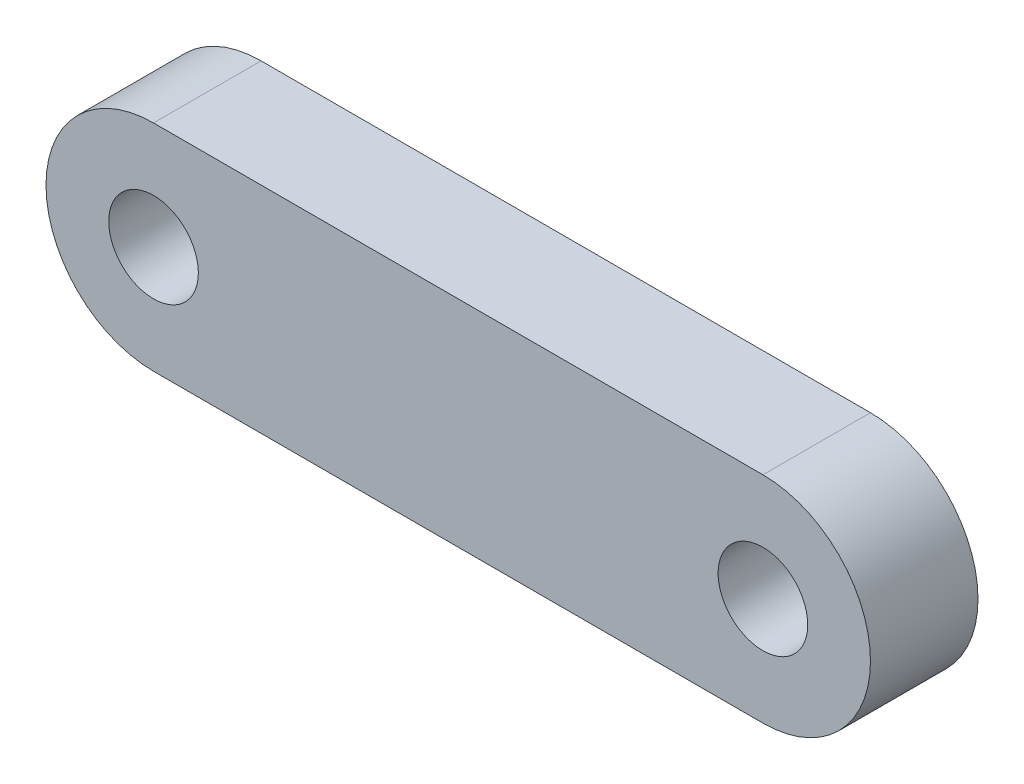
from build123d import *

# Parameters (mm, degrees)
SKETCH1_R           = 1.25
BOSS_EXTRUDE1_DEPTH = 3


with BuildPart() as part:
    # Sketch1 → Boss-Extrude1 (new body)
    with BuildSketch(Plane.XY):
        with BuildLine():
            Line((0, -3), (-17, -3))
            ThreePointArc((-17, -3), (-20, 0), (-17, 3))
            Line((-17, 3), (0, 3))
            ThreePointArc((0, 3), (3, 0), (0, -3))
        make_face()
        Circle(SKETCH1_R, mode=Mode.SUBTRACT)
        with Locations((-17, 0)):
            Circle(SKETCH1_R, mode=Mode.SUBTRACT)
    extrude(amount=BOSS_EXTRUDE1_DEPTH)


solid = part.part
